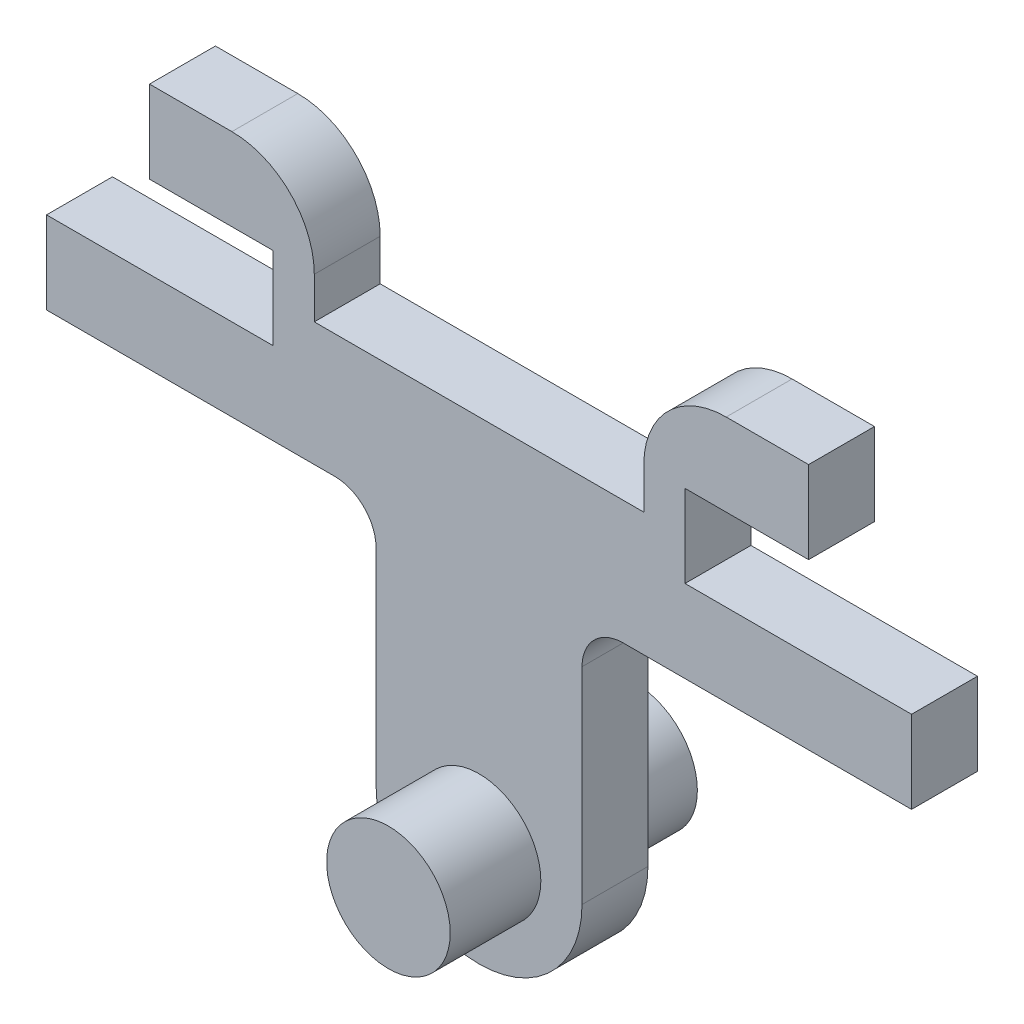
from build123d import *

# Parameters (mm, degrees)
SKETCH1_R      = 7.5
EXTRUDE1_DEPTH = 15
EXTRUDE2_DEPTH = 4


with BuildPart() as part:
    # Sketch1 → Extrude1 (new, symmetric)
    with BuildSketch(Plane.XY):
        Circle(SKETCH1_R)
    extrude(amount=EXTRUDE1_DEPTH, both=True)

    # Sketch2 → Extrude2 (add, symmetric)
    with BuildSketch(Plane(origin=(0, 0, 0), x_dir=(-1, 0, 0), z_dir=(0, 0, -1))):
        with BuildLine():
            Line((-12.5, 0), (-12.5, 25))
            ThreePointArc((-12.5, 25), (-13.964466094, 28.535533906), (-17.5, 30))
            Line((-17.5, 30), (-52.5, 30))
            Line((-52.5, 30), (-52.5, 40))
            Line((-52.5, 40), (-25, 40))
            Line((-25, 40), (-25, 50))
            Line((-25, 50), (-40, 50))
            Line((-40, 50), (-40, 60))
            Line((-40, 60), (-30, 60))
            ThreePointArc((-30, 60), (-22.928932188, 57.071067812), (-20, 50))
            Line((-20, 50), (-20, 45))
            Line((-20, 45), (20, 45))
            Line((20, 45), (20, 50))
            ThreePointArc((20, 50), (22.928932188, 57.071067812), (30, 60))
            Line((30, 60), (40, 60))
            Line((40, 60), (40, 50))
            Line((40, 50), (25, 50))
            Line((25, 50), (25, 40))
            Line((25, 40), (52.5, 40))
            Line((52.5, 40), (52.5, 30))
            Line((52.5, 30), (17.5, 30))
            ThreePointArc((17.5, 30), (13.964466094, 28.535533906), (12.5, 25))
            Line((12.5, 25), (12.5, 0))
            ThreePointArc((12.5, 0), (0, -12.5), (-12.5, 0))
        make_face()
    extrude(amount=EXTRUDE2_DEPTH, both=True)


solid = part.part
